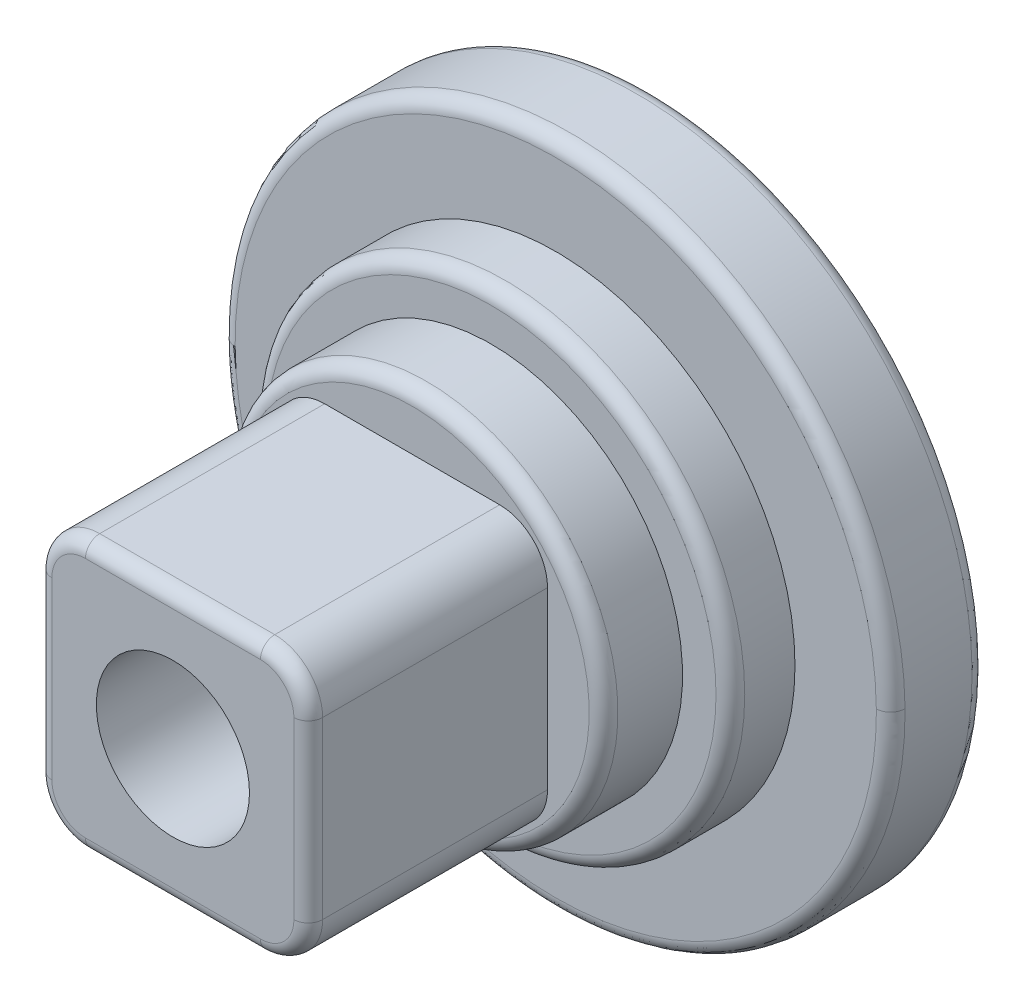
ISO-10303-21;
HEADER;
FILE_DESCRIPTION(('STEP AP214'),'2;1');
FILE_NAME('part.step','',(''),(''),'','','');
FILE_SCHEMA(('AUTOMOTIVE_DESIGN { 1 0 10303 214 1 1 1 1 }'));
ENDSEC;
DATA;
#1=APPLICATION_CONTEXT('core data for automotive mechanical design processes');
#2=APPLICATION_PROTOCOL_DEFINITION('international standard','automotive_design',2000,#1);
#3=PRODUCT_CONTEXT('',#1,'mechanical');
#4=PRODUCT('Part','Part','',(#3));
#5=PRODUCT_RELATED_PRODUCT_CATEGORY('part','',(#4));
#6=PRODUCT_DEFINITION_FORMATION('','',#4);
#7=PRODUCT_DEFINITION_CONTEXT('part definition',#1,'design');
#8=PRODUCT_DEFINITION('design','',#6,#7);
#9=PRODUCT_DEFINITION_SHAPE('','',#8);
#10=(LENGTH_UNIT() NAMED_UNIT(*) SI_UNIT(.MILLI.,.METRE.));
#11=(NAMED_UNIT(*) PLANE_ANGLE_UNIT() SI_UNIT($,.RADIAN.));
#12=(NAMED_UNIT(*) SI_UNIT($,.STERADIAN.) SOLID_ANGLE_UNIT());
#13=UNCERTAINTY_MEASURE_WITH_UNIT(LENGTH_MEASURE(1.E-05),#10,'distance_accuracy_value','');
#14=(GEOMETRIC_REPRESENTATION_CONTEXT(3) GLOBAL_UNCERTAINTY_ASSIGNED_CONTEXT((#13)) GLOBAL_UNIT_ASSIGNED_CONTEXT((#10,
#11,#12)) REPRESENTATION_CONTEXT('',''));
#15=CARTESIAN_POINT('',(0.,0.,0.));
#16=DIRECTION('',(0.,0.,1.));
#17=DIRECTION('',(1.,0.,0.));
#18=AXIS2_PLACEMENT_3D('',#15,#16,#17);
#19=CARTESIAN_POINT('',(1.828427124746,1.828427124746,-17.58904512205));
#20=DIRECTION('',(0.,0.,1.));
#21=DIRECTION('',(1.,0.,0.));
#22=AXIS2_PLACEMENT_3D('',#19,#20,#21);
#23=CYLINDRICAL_SURFACE('',#22,1.);
#24=DIRECTION('',(0.,0.,-1.));
#25=VECTOR('',#24,1.);
#26=CARTESIAN_POINT('',(2.828427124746,1.828427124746,-17.58904512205));
#27=LINE('',#26,#25);
#28=CARTESIAN_POINT('',(2.828427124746,1.828427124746,3.));
#29=VERTEX_POINT('',#28);
#30=CARTESIAN_POINT('',(2.828427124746,1.828427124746,7.7));
#31=VERTEX_POINT('',#30);
#32=EDGE_CURVE('E93',#29,#31,#27,.F.);
#33=ORIENTED_EDGE('',*,*,#32,.F.);
#34=CARTESIAN_POINT('',(1.828427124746,1.828427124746,3.));
#35=DIRECTION('',(0.,0.,1.));
#36=DIRECTION('',(1.,0.,0.));
#37=AXIS2_PLACEMENT_3D('',#34,#35,#36);
#38=CIRCLE('',#37,1.);
#39=CARTESIAN_POINT('',(1.828427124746,2.828427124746,3.));
#40=VERTEX_POINT('',#39);
#41=EDGE_CURVE('E96',#29,#40,#38,.T.);
#42=ORIENTED_EDGE('',*,*,#41,.T.);
#43=DIRECTION('',(0.,0.,1.));
#44=VECTOR('',#43,1.);
#45=CARTESIAN_POINT('',(1.828427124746,2.828427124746,-17.58904512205));
#46=LINE('',#45,#44);
#47=CARTESIAN_POINT('',(1.828427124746,2.828427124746,7.7));
#48=VERTEX_POINT('',#47);
#49=EDGE_CURVE('E125',#48,#40,#46,.F.);
#50=ORIENTED_EDGE('',*,*,#49,.F.);
#51=CARTESIAN_POINT('',(1.828427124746,1.828427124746,7.7));
#52=DIRECTION('',(0.,0.,1.));
#53=DIRECTION('',(1.,0.,0.));
#54=AXIS2_PLACEMENT_3D('',#51,#52,#53);
#55=CIRCLE('',#54,1.);
#56=EDGE_CURVE('E99',#48,#31,#55,.F.);
#57=ORIENTED_EDGE('',*,*,#56,.T.);
#58=EDGE_LOOP('',(#33,#42,#50,#57));
#59=FACE_BOUND('',#58,.T.);
#60=ADVANCED_FACE('F17',(#59),#23,.T.);
#61=CARTESIAN_POINT('',(-1.828427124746,1.828427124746,-17.58904512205));
#62=DIRECTION('',(0.,0.,1.));
#63=DIRECTION('',(1.,0.,0.));
#64=AXIS2_PLACEMENT_3D('',#61,#62,#63);
#65=CYLINDRICAL_SURFACE('',#64,1.);
#66=DIRECTION('',(0.,0.,1.));
#67=VECTOR('',#66,1.);
#68=CARTESIAN_POINT('',(-1.828427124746,2.828427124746,-17.58904512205));
#69=LINE('',#68,#67);
#70=CARTESIAN_POINT('',(-1.828427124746,2.828427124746,3.));
#71=VERTEX_POINT('',#70);
#72=CARTESIAN_POINT('',(-1.828427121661,2.828427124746,7.7));
#73=VERTEX_POINT('',#72);
#74=EDGE_CURVE('E122',#71,#73,#69,.T.);
#75=ORIENTED_EDGE('',*,*,#74,.F.);
#76=CARTESIAN_POINT('',(-1.828427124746,1.828427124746,3.));
#77=DIRECTION('',(0.,0.,1.));
#78=DIRECTION('',(1.,0.,0.));
#79=AXIS2_PLACEMENT_3D('',#76,#77,#78);
#80=CIRCLE('',#79,1.);
#81=CARTESIAN_POINT('',(-2.828427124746,1.828427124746,3.));
#82=VERTEX_POINT('',#81);
#83=EDGE_CURVE('E117',#71,#82,#80,.T.);
#84=ORIENTED_EDGE('',*,*,#83,.T.);
#85=DIRECTION('',(0.,0.,1.));
#86=VECTOR('',#85,1.);
#87=CARTESIAN_POINT('',(-2.828427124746,1.828427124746,-17.58904512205));
#88=LINE('',#87,#86);
#89=CARTESIAN_POINT('',(-2.828427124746,1.828427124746,7.7));
#90=VERTEX_POINT('',#89);
#91=EDGE_CURVE('E461',#90,#82,#88,.F.);
#92=ORIENTED_EDGE('',*,*,#91,.F.);
#93=CARTESIAN_POINT('',(-1.828427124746,1.828427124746,7.7));
#94=DIRECTION('',(0.,0.,1.));
#95=DIRECTION('',(1.,0.,0.));
#96=AXIS2_PLACEMENT_3D('',#93,#94,#95);
#97=CIRCLE('',#96,1.);
#98=EDGE_CURVE('E492',#90,#73,#97,.F.);
#99=ORIENTED_EDGE('',*,*,#98,.T.);
#100=EDGE_LOOP('',(#75,#84,#92,#99));
#101=FACE_BOUND('',#100,.T.);
#102=ADVANCED_FACE('F315',(#101),#65,.T.);
#103=CARTESIAN_POINT('',(1.828427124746,-1.828427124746,-17.58904512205));
#104=DIRECTION('',(0.,0.,1.));
#105=DIRECTION('',(1.,0.,0.));
#106=AXIS2_PLACEMENT_3D('',#103,#104,#105);
#107=CYLINDRICAL_SURFACE('',#106,1.);
#108=DIRECTION('',(0.,0.,-1.));
#109=VECTOR('',#108,1.);
#110=CARTESIAN_POINT('',(1.828427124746,-2.828427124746,-17.58904512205));
#111=LINE('',#110,#109);
#112=CARTESIAN_POINT('',(1.828427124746,-2.828427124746,3.));
#113=VERTEX_POINT('',#112);
#114=CARTESIAN_POINT('',(1.8284271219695,-2.828427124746,7.7));
#115=VERTEX_POINT('',#114);
#116=EDGE_CURVE('E442',#113,#115,#111,.F.);
#117=ORIENTED_EDGE('',*,*,#116,.F.);
#118=CARTESIAN_POINT('',(1.828427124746,-1.828427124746,3.));
#119=DIRECTION('',(0.,0.,1.));
#120=DIRECTION('',(1.,0.,0.));
#121=AXIS2_PLACEMENT_3D('',#118,#119,#120);
#122=CIRCLE('',#121,1.);
#123=CARTESIAN_POINT('',(2.828427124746,-1.828427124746,3.));
#124=VERTEX_POINT('',#123);
#125=EDGE_CURVE('E190',#113,#124,#122,.T.);
#126=ORIENTED_EDGE('',*,*,#125,.T.);
#127=DIRECTION('',(0.,0.,-1.));
#128=VECTOR('',#127,1.);
#129=CARTESIAN_POINT('',(2.828427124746,-1.828427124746,-17.58904512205));
#130=LINE('',#129,#128);
#131=CARTESIAN_POINT('',(2.828427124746,-1.828427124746,7.7));
#132=VERTEX_POINT('',#131);
#133=EDGE_CURVE('E104',#132,#124,#130,.T.);
#134=ORIENTED_EDGE('',*,*,#133,.F.);
#135=CARTESIAN_POINT('',(1.828427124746,-1.828427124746,7.7));
#136=DIRECTION('',(0.,0.,1.));
#137=DIRECTION('',(1.,0.,0.));
#138=AXIS2_PLACEMENT_3D('',#135,#136,#137);
#139=CIRCLE('',#138,1.);
#140=EDGE_CURVE('E487',#132,#115,#139,.F.);
#141=ORIENTED_EDGE('',*,*,#140,.T.);
#142=EDGE_LOOP('',(#117,#126,#134,#141));
#143=FACE_BOUND('',#142,.T.);
#144=ADVANCED_FACE('F311',(#143),#107,.T.);
#145=CARTESIAN_POINT('',(-1.828427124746,-1.828427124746,-17.58904512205));
#146=DIRECTION('',(0.,0.,1.));
#147=DIRECTION('',(1.,0.,0.));
#148=AXIS2_PLACEMENT_3D('',#145,#146,#147);
#149=CYLINDRICAL_SURFACE('',#148,1.);
#150=DIRECTION('',(0.,0.,1.));
#151=VECTOR('',#150,1.);
#152=CARTESIAN_POINT('',(-2.828427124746,-1.828427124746,-17.58904512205));
#153=LINE('',#152,#151);
#154=CARTESIAN_POINT('',(-2.828427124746,-1.828427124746,3.));
#155=VERTEX_POINT('',#154);
#156=CARTESIAN_POINT('',(-2.828427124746,-1.8284271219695,7.7));
#157=VERTEX_POINT('',#156);
#158=EDGE_CURVE('E458',#155,#157,#153,.T.);
#159=ORIENTED_EDGE('',*,*,#158,.F.);
#160=CARTESIAN_POINT('',(-1.828427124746,-1.828427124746,3.));
#161=DIRECTION('',(0.,0.,1.));
#162=DIRECTION('',(1.,0.,0.));
#163=AXIS2_PLACEMENT_3D('',#160,#161,#162);
#164=CIRCLE('',#163,1.);
#165=CARTESIAN_POINT('',(-1.828427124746,-2.828427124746,3.));
#166=VERTEX_POINT('',#165);
#167=EDGE_CURVE('E192',#155,#166,#164,.T.);
#168=ORIENTED_EDGE('',*,*,#167,.T.);
#169=DIRECTION('',(0.,0.,-1.));
#170=VECTOR('',#169,1.);
#171=CARTESIAN_POINT('',(-1.828427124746,-2.828427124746,-17.58904512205));
#172=LINE('',#171,#170);
#173=CARTESIAN_POINT('',(-1.828427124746,-2.828427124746,7.7));
#174=VERTEX_POINT('',#173);
#175=EDGE_CURVE('E445',#174,#166,#172,.T.);
#176=ORIENTED_EDGE('',*,*,#175,.F.);
#177=CARTESIAN_POINT('',(-1.828427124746,-1.828427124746,7.7));
#178=DIRECTION('',(0.,0.,1.));
#179=DIRECTION('',(1.,0.,0.));
#180=AXIS2_PLACEMENT_3D('',#177,#178,#179);
#181=CIRCLE('',#180,1.);
#182=EDGE_CURVE('E118',#174,#157,#181,.F.);
#183=ORIENTED_EDGE('',*,*,#182,.T.);
#184=EDGE_LOOP('',(#159,#168,#176,#183));
#185=FACE_BOUND('',#184,.T.);
#186=ADVANCED_FACE('F307',(#185),#149,.T.);
#187=CARTESIAN_POINT('',(0.,0.,3.));
#188=DIRECTION('',(0.,0.,-1.));
#189=DIRECTION('',(-1.,0.,0.));
#190=AXIS2_PLACEMENT_3D('',#187,#188,#189);
#191=PLANE('',#190);
#192=CARTESIAN_POINT('',(0.,0.,3.));
#193=DIRECTION('',(0.,0.,-1.));
#194=DIRECTION('',(-1.,0.,0.));
#195=AXIS2_PLACEMENT_3D('',#192,#193,#194);
#196=CIRCLE('',#195,3.7);
#197=CARTESIAN_POINT('',(-3.7,0.,3.));
#198=VERTEX_POINT('',#197);
#199=EDGE_CURVE('E105',#198,#198,#196,.T.);
#200=ORIENTED_EDGE('',*,*,#199,.F.);
#201=EDGE_LOOP('',(#200));
#202=FACE_BOUND('',#201,.T.);
#203=ORIENTED_EDGE('',*,*,#125,.F.);
#204=DIRECTION('',(1.,0.,0.));
#205=VECTOR('',#204,1.);
#206=CARTESIAN_POINT('',(2.828427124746,-2.828427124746,3.));
#207=LINE('',#206,#205);
#208=EDGE_CURVE('E451',#166,#113,#207,.T.);
#209=ORIENTED_EDGE('',*,*,#208,.F.);
#210=ORIENTED_EDGE('',*,*,#167,.F.);
#211=DIRECTION('',(0.,1.,0.));
#212=VECTOR('',#211,1.);
#213=CARTESIAN_POINT('',(-2.828427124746,2.828427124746,3.));
#214=LINE('',#213,#212);
#215=EDGE_CURVE('E446',#82,#155,#214,.F.);
#216=ORIENTED_EDGE('',*,*,#215,.F.);
#217=ORIENTED_EDGE('',*,*,#83,.F.);
#218=DIRECTION('',(1.,0.,0.));
#219=VECTOR('',#218,1.);
#220=CARTESIAN_POINT('',(2.828427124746,2.828427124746,3.));
#221=LINE('',#220,#219);
#222=EDGE_CURVE('E115',#40,#71,#221,.F.);
#223=ORIENTED_EDGE('',*,*,#222,.F.);
#224=ORIENTED_EDGE('',*,*,#41,.F.);
#225=DIRECTION('',(0.,1.,0.));
#226=VECTOR('',#225,1.);
#227=CARTESIAN_POINT('',(2.828427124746,2.828427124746,3.));
#228=LINE('',#227,#226);
#229=EDGE_CURVE('E111',#124,#29,#228,.T.);
#230=ORIENTED_EDGE('',*,*,#229,.F.);
#231=EDGE_LOOP('',(#203,#209,#210,#216,#217,#223,#224,#230));
#232=FACE_BOUND('',#231,.T.);
#233=ADVANCED_FACE('F110',(#202,#232),#191,.F.);
#234=CARTESIAN_POINT('',(0.,0.,2.7));
#235=DIRECTION('',(0.,0.,-1.));
#236=DIRECTION('',(-1.,0.,0.));
#237=AXIS2_PLACEMENT_3D('',#234,#235,#236);
#238=TOROIDAL_SURFACE('',#237,3.7,0.3);
#239=CARTESIAN_POINT('',(0.,0.,2.7));
#240=DIRECTION('',(0.,0.,-1.));
#241=DIRECTION('',(-1.,0.,0.));
#242=AXIS2_PLACEMENT_3D('',#239,#240,#241);
#243=CIRCLE('',#242,4.);
#244=CARTESIAN_POINT('',(-4.,0.,2.7));
#245=VERTEX_POINT('',#244);
#246=EDGE_CURVE('E439',#245,#245,#243,.T.);
#247=ORIENTED_EDGE('',*,*,#246,.F.);
#248=EDGE_LOOP('',(#247));
#249=FACE_BOUND('',#248,.T.);
#250=ORIENTED_EDGE('',*,*,#199,.T.);
#251=EDGE_LOOP('',(#250));
#252=FACE_BOUND('',#251,.T.);
#253=ADVANCED_FACE('F304',(#249,#252),#238,.T.);
#254=CARTESIAN_POINT('',(2.828427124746,2.828427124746,-17.58904512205));
#255=DIRECTION('',(1.,0.,0.));
#256=DIRECTION('',(0.,0.,-1.));
#257=AXIS2_PLACEMENT_3D('',#254,#255,#256);
#258=PLANE('',#257);
#259=ORIENTED_EDGE('',*,*,#133,.T.);
#260=ORIENTED_EDGE('',*,*,#229,.T.);
#261=ORIENTED_EDGE('',*,*,#32,.T.);
#262=DIRECTION('',(0.,1.,0.));
#263=VECTOR('',#262,1.);
#264=CARTESIAN_POINT('',(2.828427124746,-1.905311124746,7.7));
#265=LINE('',#264,#263);
#266=EDGE_CURVE('E431',#132,#31,#265,.T.);
#267=ORIENTED_EDGE('',*,*,#266,.F.);
#268=EDGE_LOOP('',(#259,#260,#261,#267));
#269=FACE_BOUND('',#268,.T.);
#270=ADVANCED_FACE('F120',(#269),#258,.T.);
#271=CARTESIAN_POINT('',(2.828427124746,2.828427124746,-17.58904512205));
#272=DIRECTION('',(0.,1.,0.));
#273=DIRECTION('',(0.,0.,1.));
#274=AXIS2_PLACEMENT_3D('',#271,#272,#273);
#275=PLANE('',#274);
#276=ORIENTED_EDGE('',*,*,#49,.T.);
#277=ORIENTED_EDGE('',*,*,#222,.T.);
#278=ORIENTED_EDGE('',*,*,#74,.T.);
#279=DIRECTION('',(-1.,0.,0.));
#280=VECTOR('',#279,1.);
#281=CARTESIAN_POINT('',(1.905311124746,2.828427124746,7.7));
#282=LINE('',#281,#280);
#283=EDGE_CURVE('E420',#48,#73,#282,.T.);
#284=ORIENTED_EDGE('',*,*,#283,.F.);
#285=EDGE_LOOP('',(#276,#277,#278,#284));
#286=FACE_BOUND('',#285,.T.);
#287=ADVANCED_FACE('F297',(#286),#275,.T.);
#288=CARTESIAN_POINT('',(-2.828427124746,2.828427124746,-17.58904512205));
#289=DIRECTION('',(-1.,0.,0.));
#290=DIRECTION('',(0.,0.,1.));
#291=AXIS2_PLACEMENT_3D('',#288,#289,#290);
#292=PLANE('',#291);
#293=ORIENTED_EDGE('',*,*,#91,.T.);
#294=ORIENTED_EDGE('',*,*,#215,.T.);
#295=ORIENTED_EDGE('',*,*,#158,.T.);
#296=DIRECTION('',(0.,-1.,0.));
#297=VECTOR('',#296,1.);
#298=CARTESIAN_POINT('',(-2.828427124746,1.905311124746,7.7));
#299=LINE('',#298,#297);
#300=EDGE_CURVE('E409',#90,#157,#299,.T.);
#301=ORIENTED_EDGE('',*,*,#300,.F.);
#302=EDGE_LOOP('',(#293,#294,#295,#301));
#303=FACE_BOUND('',#302,.T.);
#304=ADVANCED_FACE('F293',(#303),#292,.T.);
#305=CARTESIAN_POINT('',(2.828427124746,-2.828427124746,-17.58904512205));
#306=DIRECTION('',(0.,-1.,0.));
#307=DIRECTION('',(0.,0.,-1.));
#308=AXIS2_PLACEMENT_3D('',#305,#306,#307);
#309=PLANE('',#308);
#310=ORIENTED_EDGE('',*,*,#175,.T.);
#311=ORIENTED_EDGE('',*,*,#208,.T.);
#312=ORIENTED_EDGE('',*,*,#116,.T.);
#313=DIRECTION('',(1.,0.,0.));
#314=VECTOR('',#313,1.);
#315=CARTESIAN_POINT('',(-1.905311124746,-2.828427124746,7.7));
#316=LINE('',#315,#314);
#317=EDGE_CURVE('E394',#174,#115,#316,.T.);
#318=ORIENTED_EDGE('',*,*,#317,.F.);
#319=EDGE_LOOP('',(#310,#311,#312,#318));
#320=FACE_BOUND('',#319,.T.);
#321=ADVANCED_FACE('F289',(#320),#309,.T.);
#322=CARTESIAN_POINT('',(0.,0.,8.));
#323=DIRECTION('',(0.,0.,-1.));
#324=DIRECTION('',(-1.,0.,0.));
#325=AXIS2_PLACEMENT_3D('',#322,#323,#324);
#326=CYLINDRICAL_SURFACE('',#325,4.);
#327=ORIENTED_EDGE('',*,*,#246,.T.);
#328=EDGE_LOOP('',(#327));
#329=FACE_BOUND('',#328,.T.);
#330=CARTESIAN_POINT('',(0.,0.,1.35));
#331=DIRECTION('',(0.,0.,-1.));
#332=DIRECTION('',(-1.,0.,0.));
#333=AXIS2_PLACEMENT_3D('',#330,#331,#332);
#334=CIRCLE('',#333,4.);
#335=CARTESIAN_POINT('',(-4.,0.,1.35));
#336=VERTEX_POINT('',#335);
#337=EDGE_CURVE('E184',#336,#336,#334,.T.);
#338=ORIENTED_EDGE('',*,*,#337,.F.);
#339=EDGE_LOOP('',(#338));
#340=FACE_BOUND('',#339,.T.);
#341=ADVANCED_FACE('F285',(#329,#340),#326,.T.);
#342=CARTESIAN_POINT('',(2.528427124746,-1.905311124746,7.7));
#343=DIRECTION('',(0.,1.,0.));
#344=DIRECTION('',(0.,0.,1.));
#345=AXIS2_PLACEMENT_3D('',#342,#343,#344);
#346=CYLINDRICAL_SURFACE('',#345,0.3);
#347=CARTESIAN_POINT('',(2.528427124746,-1.828427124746,7.7));
#348=DIRECTION('',(0.,-1.,0.));
#349=DIRECTION('',(1.,0.,0.));
#350=AXIS2_PLACEMENT_3D('',#347,#348,#349);
#351=CIRCLE('',#350,0.3);
#352=CARTESIAN_POINT('',(2.528427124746,-1.828427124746,8.));
#353=VERTEX_POINT('',#352);
#354=EDGE_CURVE('E391',#132,#353,#351,.T.);
#355=ORIENTED_EDGE('',*,*,#354,.F.);
#356=ORIENTED_EDGE('',*,*,#266,.T.);
#357=CARTESIAN_POINT('',(2.528427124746,1.828427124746,7.7));
#358=DIRECTION('',(0.,1.,0.));
#359=DIRECTION('',(-1.,0.,0.));
#360=AXIS2_PLACEMENT_3D('',#357,#358,#359);
#361=CIRCLE('',#360,0.299999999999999);
#362=CARTESIAN_POINT('',(2.528427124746,1.828427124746,8.));
#363=VERTEX_POINT('',#362);
#364=EDGE_CURVE('E426',#363,#31,#361,.T.);
#365=ORIENTED_EDGE('',*,*,#364,.F.);
#366=DIRECTION('',(0.,1.,0.));
#367=VECTOR('',#366,1.);
#368=CARTESIAN_POINT('',(2.528427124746,0.,8.));
#369=LINE('',#368,#367);
#370=EDGE_CURVE('E183',#353,#363,#369,.T.);
#371=ORIENTED_EDGE('',*,*,#370,.F.);
#372=EDGE_LOOP('',(#355,#356,#365,#371));
#373=FACE_BOUND('',#372,.T.);
#374=ADVANCED_FACE('F282',(#373),#346,.T.);
#375=CARTESIAN_POINT('',(1.828427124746,1.828427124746,7.7));
#376=DIRECTION('',(0.,0.,1.));
#377=DIRECTION('',(1.,0.,0.));
#378=AXIS2_PLACEMENT_3D('',#375,#376,#377);
#379=TOROIDAL_SURFACE('',#378,0.700000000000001,0.299999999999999);
#380=ORIENTED_EDGE('',*,*,#364,.T.);
#381=ORIENTED_EDGE('',*,*,#56,.F.);
#382=CARTESIAN_POINT('',(1.828427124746,2.528427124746,7.7));
#383=DIRECTION('',(-1.,0.,0.));
#384=DIRECTION('',(0.,0.,1.));
#385=AXIS2_PLACEMENT_3D('',#382,#383,#384);
#386=CIRCLE('',#385,0.3);
#387=CARTESIAN_POINT('',(1.828427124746,2.528427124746,8.));
#388=VERTEX_POINT('',#387);
#389=EDGE_CURVE('E423',#388,#48,#386,.T.);
#390=ORIENTED_EDGE('',*,*,#389,.F.);
#391=CARTESIAN_POINT('',(1.828427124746,1.828427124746,8.));
#392=DIRECTION('',(0.,0.,1.));
#393=DIRECTION('',(1.,0.,0.));
#394=AXIS2_PLACEMENT_3D('',#391,#392,#393);
#395=CIRCLE('',#394,0.700000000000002);
#396=EDGE_CURVE('E180',#363,#388,#395,.T.);
#397=ORIENTED_EDGE('',*,*,#396,.F.);
#398=EDGE_LOOP('',(#380,#381,#390,#397));
#399=FACE_BOUND('',#398,.T.);
#400=ADVANCED_FACE('F280',(#399),#379,.T.);
#401=CARTESIAN_POINT('',(1.905311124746,2.528427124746,7.7));
#402=DIRECTION('',(-1.,0.,0.));
#403=DIRECTION('',(0.,0.,1.));
#404=AXIS2_PLACEMENT_3D('',#401,#402,#403);
#405=CYLINDRICAL_SURFACE('',#404,0.3);
#406=ORIENTED_EDGE('',*,*,#389,.T.);
#407=ORIENTED_EDGE('',*,*,#283,.T.);
#408=CARTESIAN_POINT('',(-1.8284271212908,2.528427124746,7.7));
#409=DIRECTION('',(-1.,4.93599926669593E-09,0.));
#410=DIRECTION('',(-4.93599926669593E-09,-1.,0.));
#411=AXIS2_PLACEMENT_3D('',#408,#409,#410);
#412=CIRCLE('',#411,0.299999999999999);
#413=CARTESIAN_POINT('',(-1.8284271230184,2.528427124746,8.));
#414=VERTEX_POINT('',#413);
#415=EDGE_CURVE('E415',#414,#73,#412,.T.);
#416=ORIENTED_EDGE('',*,*,#415,.F.);
#417=DIRECTION('',(1.,0.,0.));
#418=VECTOR('',#417,1.);
#419=CARTESIAN_POINT('',(0.,2.528427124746,8.));
#420=LINE('',#419,#418);
#421=EDGE_CURVE('E179',#388,#414,#420,.F.);
#422=ORIENTED_EDGE('',*,*,#421,.F.);
#423=EDGE_LOOP('',(#406,#407,#416,#422));
#424=FACE_BOUND('',#423,.T.);
#425=ADVANCED_FACE('F277',(#424),#405,.T.);
#426=CARTESIAN_POINT('',(-1.828427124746,1.828427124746,7.7));
#427=DIRECTION('',(0.,0.,1.));
#428=DIRECTION('',(0.,-1.,0.));
#429=AXIS2_PLACEMENT_3D('',#426,#427,#428);
#430=TOROIDAL_SURFACE('',#429,0.700000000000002,0.299999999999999);
#431=ORIENTED_EDGE('',*,*,#415,.T.);
#432=ORIENTED_EDGE('',*,*,#98,.F.);
#433=CARTESIAN_POINT('',(-2.528427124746,1.828427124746,7.7));
#434=DIRECTION('',(0.,-1.,0.));
#435=DIRECTION('',(0.,0.,-1.));
#436=AXIS2_PLACEMENT_3D('',#433,#434,#435);
#437=CIRCLE('',#436,0.3);
#438=CARTESIAN_POINT('',(-2.528427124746,1.828427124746,8.));
#439=VERTEX_POINT('',#438);
#440=EDGE_CURVE('E412',#439,#90,#437,.T.);
#441=ORIENTED_EDGE('',*,*,#440,.F.);
#442=CARTESIAN_POINT('',(-1.828427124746,1.828427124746,8.));
#443=DIRECTION('',(0.,0.,1.));
#444=DIRECTION('',(0.,-1.,0.));
#445=AXIS2_PLACEMENT_3D('',#442,#443,#444);
#446=CIRCLE('',#445,0.700000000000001);
#447=EDGE_CURVE('E176',#414,#439,#446,.T.);
#448=ORIENTED_EDGE('',*,*,#447,.F.);
#449=EDGE_LOOP('',(#431,#432,#441,#448));
#450=FACE_BOUND('',#449,.T.);
#451=ADVANCED_FACE('F275',(#450),#430,.T.);
#452=CARTESIAN_POINT('',(-2.528427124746,1.905311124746,7.7));
#453=DIRECTION('',(0.,-1.,0.));
#454=DIRECTION('',(0.,0.,-1.));
#455=AXIS2_PLACEMENT_3D('',#452,#453,#454);
#456=CYLINDRICAL_SURFACE('',#455,0.3);
#457=ORIENTED_EDGE('',*,*,#440,.T.);
#458=ORIENTED_EDGE('',*,*,#300,.T.);
#459=CARTESIAN_POINT('',(-2.528427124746,-1.8284271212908,7.7));
#460=DIRECTION('',(-4.93599926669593E-09,-1.,0.));
#461=DIRECTION('',(1.,-4.93599926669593E-09,0.));
#462=AXIS2_PLACEMENT_3D('',#459,#460,#461);
#463=CIRCLE('',#462,0.299999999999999);
#464=CARTESIAN_POINT('',(-2.528427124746,-1.8284271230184,8.));
#465=VERTEX_POINT('',#464);
#466=EDGE_CURVE('E404',#465,#157,#463,.T.);
#467=ORIENTED_EDGE('',*,*,#466,.F.);
#468=DIRECTION('',(0.,1.,0.));
#469=VECTOR('',#468,1.);
#470=CARTESIAN_POINT('',(-2.528427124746,0.,8.));
#471=LINE('',#470,#469);
#472=EDGE_CURVE('E175',#439,#465,#471,.F.);
#473=ORIENTED_EDGE('',*,*,#472,.F.);
#474=EDGE_LOOP('',(#457,#458,#467,#473));
#475=FACE_BOUND('',#474,.T.);
#476=ADVANCED_FACE('F272',(#475),#456,.T.);
#477=CARTESIAN_POINT('',(-1.828427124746,-1.828427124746,7.7));
#478=DIRECTION('',(0.,0.,1.));
#479=DIRECTION('',(1.,0.,0.));
#480=AXIS2_PLACEMENT_3D('',#477,#478,#479);
#481=TOROIDAL_SURFACE('',#480,0.700000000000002,0.299999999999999);
#482=ORIENTED_EDGE('',*,*,#466,.T.);
#483=ORIENTED_EDGE('',*,*,#182,.F.);
#484=CARTESIAN_POINT('',(-1.828427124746,-2.528427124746,7.7));
#485=DIRECTION('',(1.,0.,0.));
#486=DIRECTION('',(0.,0.,-1.));
#487=AXIS2_PLACEMENT_3D('',#484,#485,#486);
#488=CIRCLE('',#487,0.3);
#489=CARTESIAN_POINT('',(-1.828427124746,-2.528427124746,8.));
#490=VERTEX_POINT('',#489);
#491=EDGE_CURVE('E401',#490,#174,#488,.T.);
#492=ORIENTED_EDGE('',*,*,#491,.F.);
#493=CARTESIAN_POINT('',(-1.828427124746,-1.828427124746,8.));
#494=DIRECTION('',(0.,0.,1.));
#495=DIRECTION('',(1.,0.,0.));
#496=AXIS2_PLACEMENT_3D('',#493,#494,#495);
#497=CIRCLE('',#496,0.700000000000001);
#498=EDGE_CURVE('E172',#465,#490,#497,.T.);
#499=ORIENTED_EDGE('',*,*,#498,.F.);
#500=EDGE_LOOP('',(#482,#483,#492,#499));
#501=FACE_BOUND('',#500,.T.);
#502=ADVANCED_FACE('F270',(#501),#481,.T.);
#503=CARTESIAN_POINT('',(-1.905311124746,-2.528427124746,7.7));
#504=DIRECTION('',(1.,0.,0.));
#505=DIRECTION('',(0.,0.,-1.));
#506=AXIS2_PLACEMENT_3D('',#503,#504,#505);
#507=CYLINDRICAL_SURFACE('',#506,0.3);
#508=ORIENTED_EDGE('',*,*,#491,.T.);
#509=ORIENTED_EDGE('',*,*,#317,.T.);
#510=CARTESIAN_POINT('',(1.8284271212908,-2.528427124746,7.7));
#511=DIRECTION('',(1.,-4.93599926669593E-09,0.));
#512=DIRECTION('',(4.93599926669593E-09,1.,0.));
#513=AXIS2_PLACEMENT_3D('',#510,#511,#512);
#514=CIRCLE('',#513,0.299999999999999);
#515=CARTESIAN_POINT('',(1.8284271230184,-2.528427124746,8.));
#516=VERTEX_POINT('',#515);
#517=EDGE_CURVE('E187',#516,#115,#514,.T.);
#518=ORIENTED_EDGE('',*,*,#517,.F.);
#519=DIRECTION('',(1.,0.,0.));
#520=VECTOR('',#519,1.);
#521=CARTESIAN_POINT('',(0.,-2.528427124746,8.));
#522=LINE('',#521,#520);
#523=EDGE_CURVE('E171',#490,#516,#522,.T.);
#524=ORIENTED_EDGE('',*,*,#523,.F.);
#525=EDGE_LOOP('',(#508,#509,#518,#524));
#526=FACE_BOUND('',#525,.T.);
#527=ADVANCED_FACE('F267',(#526),#507,.T.);
#528=CARTESIAN_POINT('',(1.828427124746,-1.828427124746,7.7));
#529=DIRECTION('',(0.,0.,1.));
#530=DIRECTION('',(0.,-1.,0.));
#531=AXIS2_PLACEMENT_3D('',#528,#529,#530);
#532=TOROIDAL_SURFACE('',#531,0.700000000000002,0.299999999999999);
#533=ORIENTED_EDGE('',*,*,#517,.T.);
#534=ORIENTED_EDGE('',*,*,#140,.F.);
#535=ORIENTED_EDGE('',*,*,#354,.T.);
#536=CARTESIAN_POINT('',(1.828427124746,-1.828427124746,8.));
#537=DIRECTION('',(0.,0.,1.));
#538=DIRECTION('',(0.,-1.,0.));
#539=AXIS2_PLACEMENT_3D('',#536,#537,#538);
#540=CIRCLE('',#539,0.700000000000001);
#541=EDGE_CURVE('E168',#516,#353,#540,.T.);
#542=ORIENTED_EDGE('',*,*,#541,.F.);
#543=EDGE_LOOP('',(#533,#534,#535,#542));
#544=FACE_BOUND('',#543,.T.);
#545=ADVANCED_FACE('F265',(#544),#532,.T.);
#546=CARTESIAN_POINT('',(0.,0.,1.35));
#547=DIRECTION('',(0.,0.,1.));
#548=DIRECTION('',(1.,0.,0.));
#549=AXIS2_PLACEMENT_3D('',#546,#547,#548);
#550=PLANE('',#549);
#551=CARTESIAN_POINT('',(0.,0.,1.34999999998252));
#552=DIRECTION('',(0.,0.,1.));
#553=DIRECTION('',(1.,0.,0.));
#554=AXIS2_PLACEMENT_3D('',#551,#552,#553);
#555=CIRCLE('',#554,4.70000323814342);
#556=CARTESIAN_POINT('',(4.70000323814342,0.,1.34999999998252));
#557=VERTEX_POINT('',#556);
#558=EDGE_CURVE('E165',#557,#557,#555,.F.);
#559=ORIENTED_EDGE('',*,*,#558,.F.);
#560=EDGE_LOOP('',(#559));
#561=FACE_BOUND('',#560,.T.);
#562=ORIENTED_EDGE('',*,*,#337,.T.);
#563=EDGE_LOOP('',(#562));
#564=FACE_BOUND('',#563,.T.);
#565=ADVANCED_FACE('F261',(#561,#564),#550,.T.);
#566=CARTESIAN_POINT('',(0.,0.,8.));
#567=DIRECTION('',(0.,0.,1.));
#568=DIRECTION('',(1.,0.,0.));
#569=AXIS2_PLACEMENT_3D('',#566,#567,#568);
#570=PLANE('',#569);
#571=ORIENTED_EDGE('',*,*,#523,.T.);
#572=ORIENTED_EDGE('',*,*,#541,.T.);
#573=ORIENTED_EDGE('',*,*,#370,.T.);
#574=ORIENTED_EDGE('',*,*,#396,.T.);
#575=ORIENTED_EDGE('',*,*,#421,.T.);
#576=ORIENTED_EDGE('',*,*,#447,.T.);
#577=ORIENTED_EDGE('',*,*,#472,.T.);
#578=ORIENTED_EDGE('',*,*,#498,.T.);
#579=EDGE_LOOP('',(#571,#572,#573,#574,#575,#576,#577,#578));
#580=FACE_BOUND('',#579,.T.);
#581=CARTESIAN_POINT('',(0.,0.,8.));
#582=DIRECTION('',(0.,0.,1.));
#583=DIRECTION('',(1.,0.,0.));
#584=AXIS2_PLACEMENT_3D('',#581,#582,#583);
#585=CIRCLE('',#584,1.6);
#586=CARTESIAN_POINT('',(1.6,0.,8.));
#587=VERTEX_POINT('',#586);
#588=EDGE_CURVE('E162',#587,#587,#585,.F.);
#589=ORIENTED_EDGE('',*,*,#588,.T.);
#590=EDGE_LOOP('',(#589));
#591=FACE_BOUND('',#590,.T.);
#592=ADVANCED_FACE('F258',(#580,#591),#570,.T.);
#593=CARTESIAN_POINT('',(0.,0.,1.05));
#594=DIRECTION('',(0.,0.,1.));
#595=DIRECTION('',(1.,0.,0.));
#596=AXIS2_PLACEMENT_3D('',#593,#594,#595);
#597=TOROIDAL_SURFACE('',#596,4.7,0.3);
#598=CARTESIAN_POINT('',(0.,0.,1.05));
#599=DIRECTION('',(0.,0.,1.));
#600=DIRECTION('',(1.,0.,0.));
#601=AXIS2_PLACEMENT_3D('',#598,#599,#600);
#602=CIRCLE('',#601,5.);
#603=CARTESIAN_POINT('',(5.,0.,1.05));
#604=VERTEX_POINT('',#603);
#605=EDGE_CURVE('E161',#604,#604,#602,.F.);
#606=ORIENTED_EDGE('',*,*,#605,.F.);
#607=EDGE_LOOP('',(#606));
#608=FACE_BOUND('',#607,.T.);
#609=ORIENTED_EDGE('',*,*,#558,.T.);
#610=EDGE_LOOP('',(#609));
#611=FACE_BOUND('',#610,.T.);
#612=ADVANCED_FACE('F256',(#608,#611),#597,.T.);
#613=CARTESIAN_POINT('',(0.,0.,8.));
#614=DIRECTION('',(0.,0.,1.));
#615=DIRECTION('',(1.,0.,0.));
#616=AXIS2_PLACEMENT_3D('',#613,#614,#615);
#617=CYLINDRICAL_SURFACE('',#616,1.6);
#618=ORIENTED_EDGE('',*,*,#588,.F.);
#619=EDGE_LOOP('',(#618));
#620=FACE_BOUND('',#619,.T.);
#621=CARTESIAN_POINT('',(0.,0.,2.));
#622=DIRECTION('',(0.,0.,1.));
#623=DIRECTION('',(1.,0.,0.));
#624=AXIS2_PLACEMENT_3D('',#621,#622,#623);
#625=CIRCLE('',#624,1.6);
#626=CARTESIAN_POINT('',(1.6,0.,2.));
#627=VERTEX_POINT('',#626);
#628=EDGE_CURVE('E158',#627,#627,#625,.T.);
#629=ORIENTED_EDGE('',*,*,#628,.F.);
#630=EDGE_LOOP('',(#629));
#631=FACE_BOUND('',#630,.T.);
#632=ADVANCED_FACE('F252',(#620,#631),#617,.F.);
#633=CARTESIAN_POINT('',(0.,0.,0.));
#634=DIRECTION('',(0.,0.,1.));
#635=DIRECTION('',(1.,0.,0.));
#636=AXIS2_PLACEMENT_3D('',#633,#634,#635);
#637=CYLINDRICAL_SURFACE('',#636,5.);
#638=ORIENTED_EDGE('',*,*,#605,.T.);
#639=EDGE_LOOP('',(#638));
#640=FACE_BOUND('',#639,.T.);
#641=CARTESIAN_POINT('',(0.,0.,0.));
#642=DIRECTION('',(0.,0.,1.));
#643=DIRECTION('',(1.,0.,0.));
#644=AXIS2_PLACEMENT_3D('',#641,#642,#643);
#645=CIRCLE('',#644,5.);
#646=CARTESIAN_POINT('',(5.,0.,0.));
#647=VERTEX_POINT('',#646);
#648=EDGE_CURVE('E155',#647,#647,#645,.T.);
#649=ORIENTED_EDGE('',*,*,#648,.T.);
#650=EDGE_LOOP('',(#649));
#651=FACE_BOUND('',#650,.T.);
#652=ADVANCED_FACE('F248',(#640,#651),#637,.T.);
#653=CARTESIAN_POINT('',(0.,0.,2.));
#654=DIRECTION('',(0.,0.,-1.));
#655=DIRECTION('',(-1.,0.,0.));
#656=AXIS2_PLACEMENT_3D('',#653,#654,#655);
#657=PLANE('',#656);
#658=CARTESIAN_POINT('',(0.,0.,2.));
#659=DIRECTION('',(0.,0.,-1.));
#660=DIRECTION('',(-1.,0.,0.));
#661=AXIS2_PLACEMENT_3D('',#658,#659,#660);
#662=CIRCLE('',#661,2.);
#663=CARTESIAN_POINT('',(-2.,0.,2.));
#664=VERTEX_POINT('',#663);
#665=EDGE_CURVE('E150',#664,#664,#662,.T.);
#666=ORIENTED_EDGE('',*,*,#665,.T.);
#667=EDGE_LOOP('',(#666));
#668=FACE_BOUND('',#667,.T.);
#669=ORIENTED_EDGE('',*,*,#628,.T.);
#670=EDGE_LOOP('',(#669));
#671=FACE_BOUND('',#670,.T.);
#672=ADVANCED_FACE('F244',(#668,#671),#657,.T.);
#673=CARTESIAN_POINT('',(0.,0.,0.));
#674=DIRECTION('',(0.,0.,-1.));
#675=DIRECTION('',(-1.,0.,0.));
#676=AXIS2_PLACEMENT_3D('',#673,#674,#675);
#677=PLANE('',#676);
#678=CARTESIAN_POINT('',(0.,0.,0.));
#679=DIRECTION('',(0.,0.,1.));
#680=DIRECTION('',(1.,0.,0.));
#681=AXIS2_PLACEMENT_3D('',#678,#679,#680);
#682=CIRCLE('',#681,6.7);
#683=CARTESIAN_POINT('',(-6.69962499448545,-0.070756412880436,0.));
#684=VERTEX_POINT('',#683);
#685=CARTESIAN_POINT('',(6.69962637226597,0.070756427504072,0.));
#686=VERTEX_POINT('',#685);
#687=EDGE_CURVE('E194',#684,#686,#682,.F.);
#688=ORIENTED_EDGE('',*,*,#687,.F.);
#689=CARTESIAN_POINT('',(6.69962637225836,0.0707564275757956,0.));
#690=CARTESIAN_POINT('',(6.74107452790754,-3.85379383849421,0.));
#691=CARTESIAN_POINT('',(3.99530669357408,-6.65817821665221,0.));
#692=CARTESIAN_POINT('',(0.0707564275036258,-6.69962637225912,0.));
#693=CARTESIAN_POINT('',(-3.85379383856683,-6.74107452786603,0.));
#694=CARTESIAN_POINT('',(-6.65817821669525,-3.99530669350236,0.));
#695=CARTESIAN_POINT('',(-6.69962637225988,-0.070756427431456,0.));
#696=(BOUNDED_CURVE() B_SPLINE_CURVE(3,(#689,#690,#691,#692,#693,#694,#695),.UNSPECIFIED.,.F.,
.F.) B_SPLINE_CURVE_WITH_KNOTS((4,3,4),(0.,0.5,1.),
.UNSPECIFIED.) CURVE() GEOMETRIC_REPRESENTATION_ITEM() RATIONAL_B_SPLINE_CURVE((1.,
0.804737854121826,0.804737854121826,1.,0.804737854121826,0.804737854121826,1.)) REPRESENTATION_ITEM(''));
#697=CARTESIAN_POINT('',(6.69999999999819,0.,0.));
#698=VERTEX_POINT('',#697);
#699=EDGE_CURVE('E149',#698,#684,#696,.T.);
#700=ORIENTED_EDGE('',*,*,#699,.F.);
#701=DIRECTION('',(-0.00528040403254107,0.999986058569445,0.));
#702=VECTOR('',#701,1.);
#703=CARTESIAN_POINT('',(6.7,0.,0.));
#704=LINE('',#703,#702);
#705=EDGE_CURVE('E146',#686,#698,#704,.F.);
#706=ORIENTED_EDGE('',*,*,#705,.F.);
#707=EDGE_LOOP('',(#688,#700,#706));
#708=FACE_BOUND('',#707,.T.);
#709=ORIENTED_EDGE('',*,*,#648,.F.);
#710=EDGE_LOOP('',(#709));
#711=FACE_BOUND('',#710,.T.);
#712=ADVANCED_FACE('F233',(#708,#711),#677,.F.);
#713=CARTESIAN_POINT('',(0.,0.,-0.5));
#714=DIRECTION('',(0.,0.,-1.));
#715=DIRECTION('',(-1.,0.,0.));
#716=AXIS2_PLACEMENT_3D('',#713,#714,#715);
#717=CYLINDRICAL_SURFACE('',#716,2.);
#718=ORIENTED_EDGE('',*,*,#665,.F.);
#719=EDGE_LOOP('',(#718));
#720=FACE_BOUND('',#719,.T.);
#721=CARTESIAN_POINT('',(0.,0.,-0.5));
#722=DIRECTION('',(0.,0.,-1.));
#723=DIRECTION('',(-1.,0.,0.));
#724=AXIS2_PLACEMENT_3D('',#721,#722,#723);
#725=CIRCLE('',#724,2.);
#726=CARTESIAN_POINT('',(-2.,0.,-0.5));
#727=VERTEX_POINT('',#726);
#728=EDGE_CURVE('E141',#727,#727,#725,.F.);
#729=ORIENTED_EDGE('',*,*,#728,.F.);
#730=EDGE_LOOP('',(#729));
#731=FACE_BOUND('',#730,.T.);
#732=ADVANCED_FACE('F243',(#720,#731),#717,.F.);
#733=CARTESIAN_POINT('',(-6.69902640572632,-0.0707500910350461,0.));
#734=CARTESIAN_POINT('',(-6.65758196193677,-3.99494890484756,0.));
#735=CARTESIAN_POINT('',(-3.85344872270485,-6.74047084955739,0.));
#736=CARTESIAN_POINT('',(0.0707500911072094,-6.69902640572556,0.));
#737=CARTESIAN_POINT('',(3.99494890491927,-6.65758196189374,0.));
#738=CARTESIAN_POINT('',(6.7404708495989,-3.85344872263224,0.));
#739=CARTESIAN_POINT('',(6.6990264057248,0.0707500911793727,0.));
#740=CARTESIAN_POINT('',(-6.69922639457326,-0.0707522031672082,0.));
#741=CARTESIAN_POINT('',(-6.65778071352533,-3.99506816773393,0.));
#742=CARTESIAN_POINT('',(-3.8535637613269,-6.7406720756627,0.));
#743=CARTESIAN_POINT('',(0.0707522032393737,-6.69922639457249,0.));
#744=CARTESIAN_POINT('',(3.99506816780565,-6.65778071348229,0.));
#745=CARTESIAN_POINT('',(6.74067207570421,-3.85356376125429,0.));
#746=CARTESIAN_POINT('',(6.69922639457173,0.0707522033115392,0.));
#747=CARTESIAN_POINT('',(-6.69942638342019,-0.0707543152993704,0.));
#748=CARTESIAN_POINT('',(-6.65797946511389,-3.9951874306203,0.));
#749=CARTESIAN_POINT('',(-3.85367879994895,-6.74087330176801,0.));
#750=CARTESIAN_POINT('',(0.070754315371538,-6.69942638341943,0.));
#751=CARTESIAN_POINT('',(3.99518743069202,-6.65797946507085,0.));
#752=CARTESIAN_POINT('',(6.74087330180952,-3.85367879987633,0.));
#753=CARTESIAN_POINT('',(6.69942638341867,0.0707543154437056,0.));
#754=CARTESIAN_POINT('',(-6.69962637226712,-0.0707564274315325,0.));
#755=CARTESIAN_POINT('',(-6.65817821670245,-3.99530669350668,0.));
#756=CARTESIAN_POINT('',(-3.85379383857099,-6.74107452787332,0.));
#757=CARTESIAN_POINT('',(0.0707564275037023,-6.69962637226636,0.));
#758=CARTESIAN_POINT('',(3.9953066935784,-6.65817821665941,0.));
#759=CARTESIAN_POINT('',(6.74107452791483,-3.85379383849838,0.));
#760=CARTESIAN_POINT('',(6.6996263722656,0.0707564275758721,0.));
#761=CARTESIAN_POINT('',(-6.87535250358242,-0.0726123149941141,0.));
#762=CARTESIAN_POINT('',(-6.83281719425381,-4.10010056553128,0.));
#763=CARTESIAN_POINT('',(-3.95487593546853,-6.91788781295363,0.));
#764=CARTESIAN_POINT('',(0.0726123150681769,-6.87535250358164,0.));
#765=CARTESIAN_POINT('',(4.10010056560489,-6.83281719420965,0.));
#766=CARTESIAN_POINT('',(6.91788781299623,-3.95487593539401,0.));
#767=CARTESIAN_POINT('',(6.87535250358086,0.0726123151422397,0.));
#768=CARTESIAN_POINT('',(-6.99960964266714,-0.0739246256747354,-0.124264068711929));
#769=CARTESIAN_POINT('',(-6.95630559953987,-4.17420102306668,-0.124264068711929));
#770=CARTESIAN_POINT('',(-4.02635177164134,-7.04291368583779,-0.124264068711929));
#771=CARTESIAN_POINT('',(0.0739246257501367,-6.99960964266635,-0.124264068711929));
#772=CARTESIAN_POINT('',(4.17420102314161,-6.9563055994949,-0.124264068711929));
#773=CARTESIAN_POINT('',(7.04291368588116,-4.02635177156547,-0.124264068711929));
#774=CARTESIAN_POINT('',(6.99960964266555,0.073924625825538,-0.124264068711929));
#775=CARTESIAN_POINT('',(-6.99960964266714,-0.0739246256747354,-0.3));
#776=CARTESIAN_POINT('',(-6.95630559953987,-4.17420102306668,-0.3));
#777=CARTESIAN_POINT('',(-4.02635177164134,-7.04291368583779,-0.3));
#778=CARTESIAN_POINT('',(0.0739246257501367,-6.99960964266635,-0.3));
#779=CARTESIAN_POINT('',(4.17420102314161,-6.9563055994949,-0.3));
#780=CARTESIAN_POINT('',(7.04291368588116,-4.02635177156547,-0.3));
#781=CARTESIAN_POINT('',(6.99960964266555,0.073924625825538,-0.3));
#782=(BOUNDED_SURFACE() B_SPLINE_SURFACE(3,3,((#733,#734,#735,#736,#737,#738,#739),(#740,#741,
#742,#743,#744,#745,#746),(#747,#748,#749,#750,#751,#752,#753),(#754,#755,#756,#757,#758,#759,
#760),(#761,#762,#763,#764,#765,#766,#767),(#768,#769,#770,#771,#772,#773,#774),(#775,#776,#777,
#778,#779,#780,#781)),.UNSPECIFIED.,.F.,.F.,.F.) B_SPLINE_SURFACE_WITH_KNOTS((4,3,4),(4,3,4),
(-0.0014142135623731,0.,1.),(0.,0.5,1.),
.UNSPECIFIED.) GEOMETRIC_REPRESENTATION_ITEM() RATIONAL_B_SPLINE_SURFACE(((1.,0.804737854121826,
0.804737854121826,1.,0.804737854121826,0.804737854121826,1.),(1.,0.804737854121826,
0.804737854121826,1.,0.804737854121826,0.804737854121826,1.),(1.,0.804737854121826,
0.804737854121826,1.,0.804737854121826,0.804737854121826,1.),(1.,0.804737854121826,
0.804737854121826,1.,0.804737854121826,0.804737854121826,1.),(0.804737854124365,
0.647603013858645,0.647603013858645,0.804737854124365,0.647603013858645,0.647603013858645,
0.804737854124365),(0.804737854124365,0.647603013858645,0.647603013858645,0.804737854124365,
0.647603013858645,0.647603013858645,0.804737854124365),(1.,0.804737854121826,0.804737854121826,
1.,0.804737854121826,0.804737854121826,1.))) REPRESENTATION_ITEM('') SURFACE());
#783=CARTESIAN_POINT('',(0.,0.,-0.3));
#784=DIRECTION('',(0.,0.,1.));
#785=DIRECTION('',(1.,0.,0.));
#786=AXIS2_PLACEMENT_3D('',#783,#784,#785);
#787=CIRCLE('',#786,7.);
#788=CARTESIAN_POINT('',(6.99960964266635,0.0739246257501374,-0.3));
#789=VERTEX_POINT('',#788);
#790=CARTESIAN_POINT('',(-6.99960964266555,-0.0739246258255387,-0.3));
#791=VERTEX_POINT('',#790);
#792=EDGE_CURVE('E144',#789,#791,#787,.F.);
#793=CARTESIAN_POINT('',(6.69962637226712,0.0707564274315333,-0.300000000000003));
#794=DIRECTION('',(-0.0105606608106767,0.999944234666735,0.));
#795=DIRECTION('',(-0.999944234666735,-0.0105606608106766,0.));
#796=AXIS2_PLACEMENT_3D('',#793,#794,#795);
#797=CIRCLE('',#796,0.300000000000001);
#798=EDGE_CURVE('E196',#686,#789,#797,.T.);
#799=CARTESIAN_POINT('',(-6.6996263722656,-0.0707564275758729,-0.300000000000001));
#800=DIRECTION('',(-0.0105606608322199,0.999944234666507,0.));
#801=DIRECTION('',(-0.999944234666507,-0.0105606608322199,0.));
#802=AXIS2_PLACEMENT_3D('',#799,#800,#801);
#803=CIRCLE('',#802,0.3);
#804=EDGE_CURVE('E145',#791,#684,#803,.T.);
#805=ORIENTED_EDGE('',*,*,#792,.F.);
#806=ORIENTED_EDGE('',*,*,#798,.F.);
#807=ORIENTED_EDGE('',*,*,#705,.T.);
#808=ORIENTED_EDGE('',*,*,#699,.T.);
#809=ORIENTED_EDGE('',*,*,#804,.F.);
#810=EDGE_LOOP('',(#805,#806,#807,#808,#809));
#811=FACE_BOUND('',#810,.T.);
#812=ADVANCED_FACE('F208',(#811),#782,.T.);
#813=CARTESIAN_POINT('',(0.,0.,-0.300000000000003));
#814=DIRECTION('',(0.,0.,1.));
#815=DIRECTION('',(1.,0.,0.));
#816=AXIS2_PLACEMENT_3D('',#813,#814,#815);
#817=TOROIDAL_SURFACE('',#816,6.7,0.300000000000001);
#818=ORIENTED_EDGE('',*,*,#804,.T.);
#819=ORIENTED_EDGE('',*,*,#687,.T.);
#820=ORIENTED_EDGE('',*,*,#798,.T.);
#821=CARTESIAN_POINT('',(0.,0.,-0.3));
#822=DIRECTION('',(0.,0.,1.));
#823=DIRECTION('',(1.,0.,0.));
#824=AXIS2_PLACEMENT_3D('',#821,#822,#823);
#825=CIRCLE('',#824,7.);
#826=EDGE_CURVE('E140',#791,#789,#825,.F.);
#827=ORIENTED_EDGE('',*,*,#826,.F.);
#828=EDGE_LOOP('',(#818,#819,#820,#827));
#829=FACE_BOUND('',#828,.T.);
#830=ADVANCED_FACE('F218',(#829),#817,.T.);
#831=CARTESIAN_POINT('',(0.,0.,-0.5));
#832=DIRECTION('',(0.,0.,-1.));
#833=DIRECTION('',(-1.,0.,0.));
#834=AXIS2_PLACEMENT_3D('',#831,#832,#833);
#835=PLANE('',#834);
#836=CARTESIAN_POINT('',(0.,0.,-0.5));
#837=DIRECTION('',(0.,0.,1.));
#838=DIRECTION('',(1.,0.,0.));
#839=AXIS2_PLACEMENT_3D('',#836,#837,#838);
#840=CIRCLE('',#839,2.5);
#841=CARTESIAN_POINT('',(2.5,0.,-0.5));
#842=VERTEX_POINT('',#841);
#843=EDGE_CURVE('E137',#842,#842,#840,.F.);
#844=ORIENTED_EDGE('',*,*,#843,.T.);
#845=EDGE_LOOP('',(#844));
#846=FACE_BOUND('',#845,.T.);
#847=ORIENTED_EDGE('',*,*,#728,.T.);
#848=EDGE_LOOP('',(#847));
#849=FACE_BOUND('',#848,.T.);
#850=ADVANCED_FACE('F340',(#846,#849),#835,.T.);
#851=CARTESIAN_POINT('',(0.,0.,-1.));
#852=DIRECTION('',(0.,0.,1.));
#853=DIRECTION('',(1.,0.,0.));
#854=AXIS2_PLACEMENT_3D('',#851,#852,#853);
#855=CYLINDRICAL_SURFACE('',#854,7.);
#856=ORIENTED_EDGE('',*,*,#792,.T.);
#857=ORIENTED_EDGE('',*,*,#826,.T.);
#858=EDGE_LOOP('',(#856,#857));
#859=FACE_BOUND('',#858,.T.);
#860=CARTESIAN_POINT('',(0.,0.,-1.7));
#861=DIRECTION('',(0.,0.,-1.));
#862=DIRECTION('',(-1.,0.,0.));
#863=AXIS2_PLACEMENT_3D('',#860,#861,#862);
#864=CIRCLE('',#863,7.);
#865=CARTESIAN_POINT('',(-7.,0.,-1.7));
#866=VERTEX_POINT('',#865);
#867=EDGE_CURVE('E136',#866,#866,#864,.T.);
#868=ORIENTED_EDGE('',*,*,#867,.F.);
#869=EDGE_LOOP('',(#868));
#870=FACE_BOUND('',#869,.T.);
#871=ADVANCED_FACE('F346',(#859,#870),#855,.T.);
#872=CARTESIAN_POINT('',(0.,0.,-10.48528137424));
#873=DIRECTION('',(0.,0.,1.));
#874=DIRECTION('',(1.,0.,0.));
#875=AXIS2_PLACEMENT_3D('',#872,#873,#874);
#876=CYLINDRICAL_SURFACE('',#875,2.5);
#877=ORIENTED_EDGE('',*,*,#843,.F.);
#878=EDGE_LOOP('',(#877));
#879=FACE_BOUND('',#878,.T.);
#880=CARTESIAN_POINT('',(0.,0.,-2.));
#881=DIRECTION('',(0.,0.,1.));
#882=DIRECTION('',(1.,0.,0.));
#883=AXIS2_PLACEMENT_3D('',#880,#881,#882);
#884=CIRCLE('',#883,2.5);
#885=CARTESIAN_POINT('',(2.5,0.,-2.));
#886=VERTEX_POINT('',#885);
#887=EDGE_CURVE('E133',#886,#886,#884,.T.);
#888=ORIENTED_EDGE('',*,*,#887,.F.);
#889=EDGE_LOOP('',(#888));
#890=FACE_BOUND('',#889,.T.);
#891=ADVANCED_FACE('F356',(#879,#890),#876,.F.);
#892=CARTESIAN_POINT('',(0.,0.,-1.7));
#893=DIRECTION('',(0.,0.,1.));
#894=DIRECTION('',(1.,0.,0.));
#895=AXIS2_PLACEMENT_3D('',#892,#893,#894);
#896=TOROIDAL_SURFACE('',#895,6.7,0.299999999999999);
#897=ORIENTED_EDGE('',*,*,#867,.T.);
#898=EDGE_LOOP('',(#897));
#899=FACE_BOUND('',#898,.T.);
#900=DIRECTION('',(-0.00580737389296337,-0.999983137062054,0.));
#901=VECTOR('',#900,1.);
#902=CARTESIAN_POINT('',(6.7,0.,-2.));
#903=LINE('',#902,#901);
#904=CARTESIAN_POINT('',(6.7,0.,-2.));
#905=VERTEX_POINT('',#904);
#906=CARTESIAN_POINT('',(6.69955399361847,-0.0771363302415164,-1.99999999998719));
#907=VERTEX_POINT('',#906);
#908=EDGE_CURVE('E27',#905,#907,#903,.T.);
#909=ORIENTED_EDGE('',*,*,#908,.F.);
#910=CARTESIAN_POINT('',(0.,0.,-2.));
#911=DIRECTION('',(0.,0.,1.));
#912=DIRECTION('',(1.,0.,0.));
#913=AXIS2_PLACEMENT_3D('',#910,#911,#912);
#914=CIRCLE('',#913,6.7);
#915=EDGE_CURVE('E11',#907,#905,#914,.F.);
#916=ORIENTED_EDGE('',*,*,#915,.F.);
#917=EDGE_LOOP('',(#909,#916));
#918=FACE_BOUND('',#917,.T.);
#919=ADVANCED_FACE('F19',(#899,#918),#896,.T.);
#920=CARTESIAN_POINT('',(0.,0.,-2.));
#921=DIRECTION('',(0.,0.,-1.));
#922=DIRECTION('',(-1.,0.,0.));
#923=AXIS2_PLACEMENT_3D('',#920,#921,#922);
#924=PLANE('',#923);
#925=ORIENTED_EDGE('',*,*,#915,.T.);
#926=ORIENTED_EDGE('',*,*,#908,.T.);
#927=EDGE_LOOP('',(#925,#926));
#928=FACE_BOUND('',#927,.T.);
#929=ORIENTED_EDGE('',*,*,#887,.T.);
#930=EDGE_LOOP('',(#929));
#931=FACE_BOUND('',#930,.T.);
#932=ADVANCED_FACE('F349',(#928,#931),#924,.T.);
#933=CLOSED_SHELL('',(#60,#102,#144,#186,#233,#253,#270,#287,#304,#321,#341,#374,#400,#425,#451,
#476,#502,#527,#545,#565,#592,#612,#632,#652,#672,#712,#732,#812,#830,#850,#871,#891,#919,#932));
#934=MANIFOLD_SOLID_BREP('B1',#933);
#935=ADVANCED_BREP_SHAPE_REPRESENTATION('',(#18,#934),#14);
#936=SHAPE_DEFINITION_REPRESENTATION(#9,#935);
ENDSEC;
END-ISO-10303-21;
